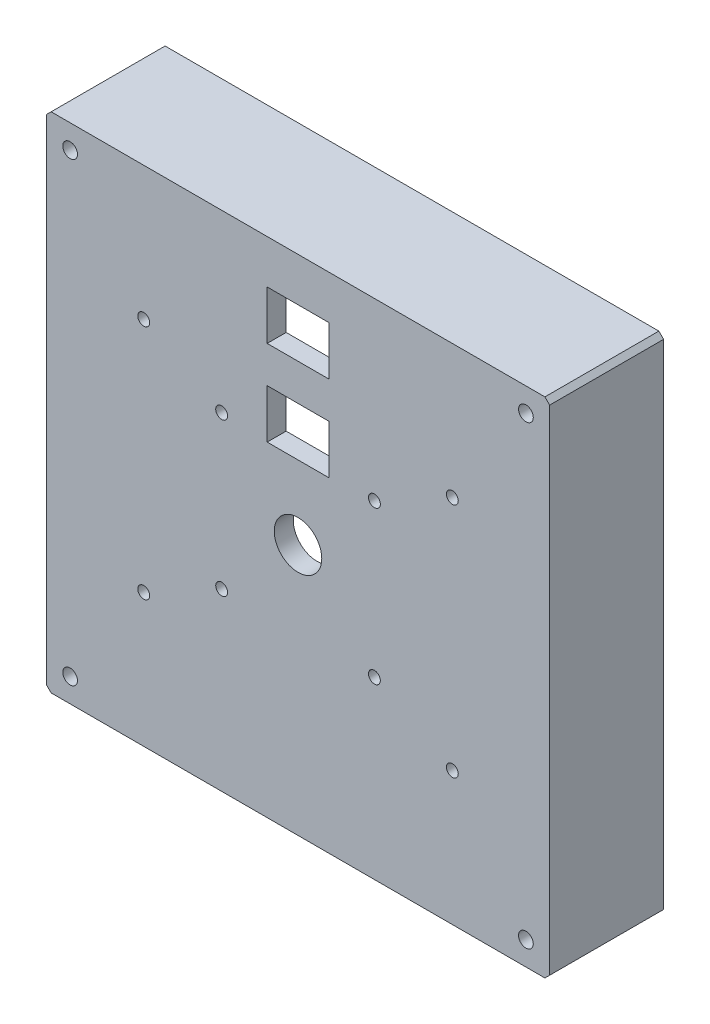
from build123d import *

# Parameters (mm, degrees)
SKETCH1_W               = 106
SKETCH1_H               = 106
BOSS_EXTRUDE1_DEPTH     = 4
SKETCH2_W               = 106
SKETCH2_H               = 106
BOSS_EXTRUDE2_DEPTH     = 20
SKETCH7_R               = 1.55
CUT_EXTRUDE2_DEPTH      = 50
SKETCH8_R               = 1.25
SKETCH8_R_2             = 5
SKETCH8_W               = 13
SKETCH8_H               = 10.3
CUT_EXTRUDE3_DEPTH      = 10
SKETCH9_R               = 4.5
BOSS_EXTRUDE3_DEPTH     = 4
SKETCH14_R              = 2.5
SKETCH14_W              = 13
SKETCH14_H              = 8
CUT_EXTRUDE4_DEPTH      = 10
CHAMFER1_SIZE           = 1
CHAMFER2_SIZE           = 1
CUT_EXTRUDE5_DEPTH      = 97
CUT_EXTRUDE5_DEPTH_BACK = 1
SKETCH15_R              = 1.6
CHAMFER3_SIZE           = 1


with BuildPart() as part:
    # Sketch1 → Boss-Extrude1 (new body)
    with BuildSketch(Plane.XY):
        Rectangle(SKETCH1_W, SKETCH1_H)
    extrude(amount=-BOSS_EXTRUDE1_DEPTH)

    # Sketch2 → Boss-Extrude2 (add)
    with BuildSketch(Plane(origin=(0, 0, -4), x_dir=(-1, 0, 0), z_dir=(0, 0, -1))):
        Rectangle(SKETCH2_W, SKETCH2_H)
        Polygon((-48, 41), (-48, -41), (-41, -48), (41, -48), (48, -41), (48, 41), (41, 48), (-41, 48), align=None, mode=Mode.SUBTRACT)
    extrude(amount=BOSS_EXTRUDE2_DEPTH)

    # Sketch7 → Cut-Extrude2 (cut)
    with BuildSketch(Plane.XY):
        with Locations((-48, 48)):
            Circle(SKETCH7_R)
        with Locations((48, 48)):
            Circle(SKETCH7_R)
        with Locations((-48, -48)):
            Circle(SKETCH7_R)
        with Locations((48, -48)):
            Circle(SKETCH7_R)
    extrude(amount=-CUT_EXTRUDE2_DEPTH, mode=Mode.SUBTRACT)

    # Sketch8 → Cut-Extrude3 (cut)
    with BuildSketch(Plane.XY):
        with Locations((32.5, 24.9)):
            Circle(SKETCH8_R)
        with Locations((-32.5, 24.9)):
            Circle(SKETCH8_R)
        with Locations((-32.5, -24.9)):
            Circle(SKETCH8_R)
        with Locations((32.5, -24.9)):
            Circle(SKETCH8_R)
        with Locations((16.086679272, -16.086679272)):
            Circle(SKETCH8_R)
        with Locations((-16.086679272, -16.086679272)):
            Circle(SKETCH8_R)
        with Locations((16.086679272, 16.086679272)):
            Circle(SKETCH8_R)
        with Locations((-16.086679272, 16.086679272)):
            Circle(SKETCH8_R)
        Circle(SKETCH8_R_2)
        with Locations((0, 38.65)):
            Rectangle(SKETCH8_W, SKETCH8_H)
        with Locations((0, 20.65)):
            Rectangle(SKETCH8_W, SKETCH8_H)
    extrude(amount=-CUT_EXTRUDE3_DEPTH, mode=Mode.SUBTRACT)

    # Sketch9 → Boss-Extrude3 (add)
    # profile 1 of 4: a face of its own
    with BuildSketch(Plane.XY.offset(-4)):
        with Locations((-34.5, 41)):
            Circle(SKETCH9_R)
        Polygon((-35.701219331, 38.1), (-33.298780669, 38.1), (-31.6, 39.798780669), (-31.6, 42.201219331), (-33.298780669, 43.9), (-35.701219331, 43.9), (-37.4, 42.201219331), (-37.4, 39.798780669), align=None, mode=Mode.SUBTRACT)
    # profile 2 of 4: a face of its own
    with BuildSketch(Plane.XY.offset(-4)):
        with Locations(Location((34.5, 41, 0), (0, 0, 180))):
            Circle(SKETCH9_R)
        Polygon((37.4, 39.798780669), (35.701219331, 38.1), (33.298780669, 38.1), (31.6, 39.798780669), (31.6, 42.201219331), (33.298780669, 43.9), (35.701219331, 43.9), (37.4, 42.201219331), align=None, mode=Mode.SUBTRACT)
    # profile 3 of 4: a face of its own
    with BuildSketch(Plane.XY.offset(-4)):
        with Locations((34.5, -41)):
            Circle(SKETCH9_R)
        Polygon((35.701219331, -38.1), (33.298780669, -38.1), (31.6, -39.798780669), (31.6, -42.201219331), (33.298780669, -43.9), (35.701219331, -43.9), (37.4, -42.201219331), (37.4, -39.798780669), align=None, mode=Mode.SUBTRACT)
    # profile 4 of 4: a face of its own
    with BuildSketch(Plane.XY.offset(-4)):
        with Locations(Location((-34.5, -41, 0), (0, 0, 180))):
            Circle(SKETCH9_R)
        Polygon((-37.4, -39.798780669), (-35.701219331, -38.1), (-33.298780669, -38.1), (-31.6, -39.798780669), (-31.6, -42.201219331), (-33.298780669, -43.9), (-35.701219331, -43.9), (-37.4, -42.201219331), align=None, mode=Mode.SUBTRACT)
    extrude(amount=-BOSS_EXTRUDE3_DEPTH)

    # Sketch14 → Cut-Extrude4 (cut)
    with BuildSketch(Plane.XZ.offset(53)):
        with Locations((-20, -10.83)):
            Circle(SKETCH14_R)
        with Locations((0, -10.83)):
            Rectangle(SKETCH14_W, SKETCH14_H)
    extrude(amount=-CUT_EXTRUDE4_DEPTH, mode=Mode.SUBTRACT)

    # Chamfer1
    chamfer1_edges = [part.edges().sort_by_distance(p)[0] for p in [
        (-53, 53, -12),
        (53, 53, -12),
        (53, -53, -12),
        (-53, -53, -12),
    ]]
    chamfer(chamfer1_edges, length=CHAMFER1_SIZE)

    # Chamfer2
    chamfer2_edges = [part.edges().sort_by_distance(p)[0] for p in [
        (-6.5, -53, -10.83),
        (0, -53, -14.83),
        (6.5, -53, -10.83),
        (0, -53, -6.83),
    ]]
    chamfer(chamfer2_edges, length=CHAMFER2_SIZE)

    # Sketch15 → Cut-Extrude5 (cut, two sides: drawn at the far end of the back side and taken through both)
    with BuildSketch(Plane.ZY.offset(-48).offset(-CUT_EXTRUDE5_DEPTH_BACK)):
        with Locations(Location((-12, -23, 0), (0, 0, 90))):
            Circle(SKETCH15_R)
        with Locations(Location((-12, 23, 0), (0, 0, 90))):
            Circle(SKETCH15_R)
    extrude(amount=CUT_EXTRUDE5_DEPTH + CUT_EXTRUDE5_DEPTH_BACK, mode=Mode.SUBTRACT)

    # Chamfer3
    chamfer3_edges = [part.edges().sort_by_distance(p)[0] for p in [
        (-22.5, -48, -10.83),
        (-22.5, -53, -10.83),
    ]]
    chamfer(chamfer3_edges, length=CHAMFER3_SIZE)


solid = part.part
